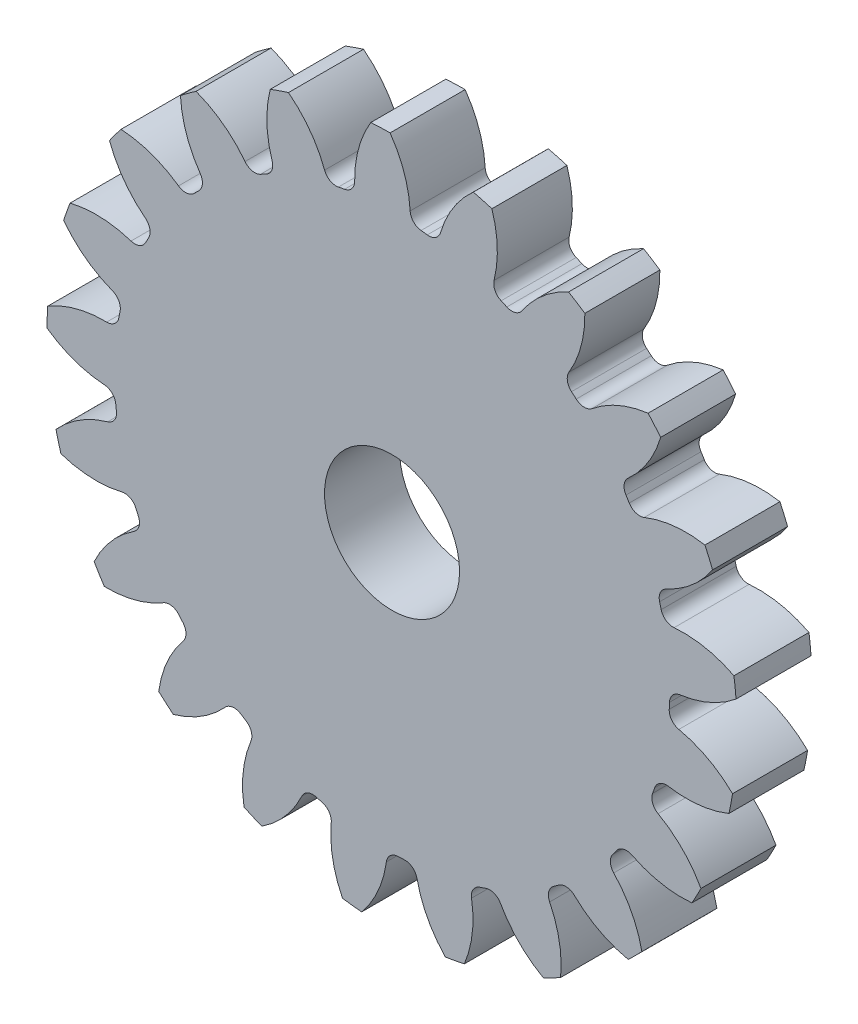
from build123d import *

# Parameters (mm, degrees)
SKETCH3_R         = 584.2
GEARBODY_DEPTH    = 127
TOOTHCUT_DEPTH    = 836.887719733
CIRPATTERN1_COUNT = 21
BOREDIA_R         = 114.3
BORE_DEPTH        = 12700


with BuildPart() as part:
    # Sketch3 → gearBody (new body)
    with BuildSketch(Plane.XY):
        Circle(SKETCH3_R)
    extrude(amount=GEARBODY_DEPTH)

    # Sketch2 → toothCut (cut, through all)
    with BuildSketch(Plane.XY):
        with BuildLine():
            ThreePointArc((469.253631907, -24.638160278), (469.500489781, -19.37266362), (469.68826536, -14.104729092))
            ThreePointArc((469.68826536, -14.104729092), (475.013371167, -0.864287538), (487.647529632, 5.772284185))
            ThreePointArc((487.647529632, 5.772284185), (538.989112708, 20.196214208), (584.2, 48.48019519))
            ThreePointArc((584.2, 48.48019519), (585.709732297, -24.167722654), (578.220083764, -96.44430547))
            ThreePointArc((578.220083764, -96.44430547), (535.493040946, -64.53180444), (485.514292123, -45.927165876))
            ThreePointArc((485.514292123, -45.927165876), (473.469831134, -38.272297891), (469.253631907, -24.638160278))
        make_face()
    toothcut = extrude(amount=TOOTHCUT_DEPTH, mode=Mode.SUBTRACT)

    # CirPattern1: toothCut ×21 about axis
    cirpattern1_axis = Axis((0, 0, 0), (0, 0, 1))
    for i in range(1, CIRPATTERN1_COUNT):
        add(toothcut.rotate(cirpattern1_axis, i * 360 / CIRPATTERN1_COUNT), mode=Mode.SUBTRACT)

    # boreDia → bore (cut, symmetric)
    with BuildSketch(Plane.XY):
        Circle(BOREDIA_R)
    extrude(amount=BORE_DEPTH, both=True, mode=Mode.SUBTRACT)


solid = part.part
